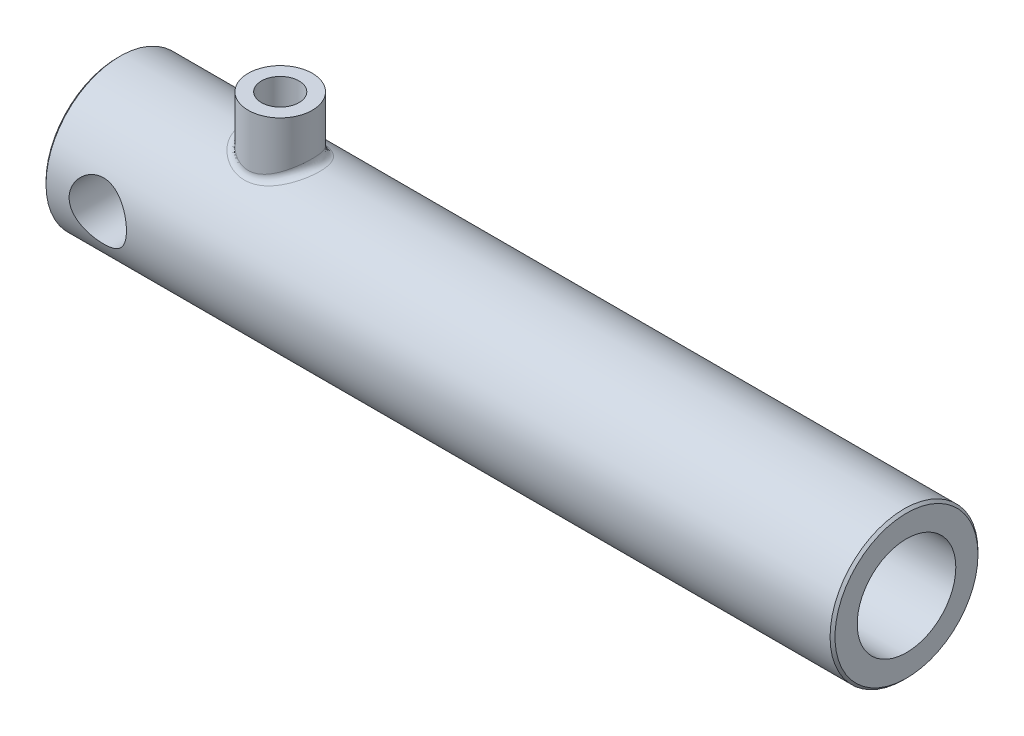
from build123d import *

# Parameters (mm, degrees)
ESQUISSE1_W                              = 320
ESQUISSE1_H                              = 30
ESQUISSE2_W                              = 13
ESQUISSE2_H                              = 22.962988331
D_GAGEMENT_M201_D                        = 23.25
DIAM_TRE_DU_PER_AGE_6_8_6_8_1_REACH      = 327.269
DIAM_TRE_DU_PER_AGE_6_8_6_8_1_BORE_R     = 3.4
DIAM_TRE_DU_PER_AGE_15_25_15_25_1_REACH  = 333.21
DIAM_TRE_DU_PER_AGE_15_25_15_25_1_BORE_R = 7.625
CHANFREIN1_SIZE                          = 1
CONG_1_R                                 = 2.999965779


with BuildPart() as part:
    # Esquisse1 → R_volution1 (revolve)
    with BuildSketch(Plane(origin=(0, 0, 0), x_dir=(-1, 0, 0), z_dir=(0, 0, -1)), mode=Mode.PRIVATE) as r_volution1_sk:
        with Locations((-160, 15)):
            Rectangle(ESQUISSE1_W, ESQUISSE1_H)
    revolve(r_volution1_sk.sketch.rotate(Axis((320, 0, 0), (-1, 0, 0)), 270), axis=Axis((320, 0, 0), (-1, 0, 0)))

    # Esquisse2 → R_volution2 (revolve)
    with BuildSketch(Plane(origin=(66, 0, 0), x_dir=(0, 0, -1), z_dir=(1, 0, 0))):
        with Locations((6.5, 38.518505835)):
            Rectangle(ESQUISSE2_W, ESQUISSE2_H)
    revolve(axis=Axis((66, 50, 0), (0, -1, 0)))

    # D_gagement M201 (through all)
    with Locations(Plane(origin=(22, 0, -30), x_dir=(0, -1, 0), z_dir=(0, 0, -1))):
        with Locations((0, 0)):
            Hole(D_GAGEMENT_M201_D / 2)

    # Diam_tre du per_age _6.8 _6.8_1 bore → Diam_tre du per_age _6.8 _6.8_1 (cut, up to next)
    with BuildSketch(Plane.ZY, mode=Mode.PRIVATE) as diam_tre_du_per_age_6_8_6_8_1_sk1:
        Circle(DIAM_TRE_DU_PER_AGE_6_8_6_8_1_BORE_R)
    diam_tre_du_per_age_6_8_6_8_1_tool1 = extrude(diam_tre_du_per_age_6_8_6_8_1_sk1.sketch, amount=-DIAM_TRE_DU_PER_AGE_6_8_6_8_1_REACH, mode=Mode.PRIVATE) & part.part
    add(diam_tre_du_per_age_6_8_6_8_1_tool1.solids().sort_by_distance((0, 0, 0))[0], mode=Mode.SUBTRACT)

    # Esquisse6 → Chambrage pour vis _ t_te hexagonale M48 (revolve, cut)
    with BuildSketch(Plane(origin=(320, 0, 0), x_dir=(0, 0, -1), z_dir=(0, 1, 0))):
        Polygon((0, 0), (0, 272), (25, 272), (25, 59), (20, 59), (20, 0), align=None)
    revolve(axis=Axis((326.35, 0, 0), (-1, 0, 0)), mode=Mode.SUBTRACT)

    # Diam_tre du per_age _15.25 _15.25_1 bore → Diam_tre du per_age _15.25 _15.25_1 (cut, up to next)
    with BuildSketch(Plane(origin=(0, 50, 0), x_dir=(1, 0, 0), z_dir=(0, 1, 0)), mode=Mode.PRIVATE) as diam_tre_du_per_age_15_25_15_25_1_sk1:
        with Locations((66, 0)):
            Circle(DIAM_TRE_DU_PER_AGE_15_25_15_25_1_BORE_R)
    diam_tre_du_per_age_15_25_15_25_1_tool1 = extrude(diam_tre_du_per_age_15_25_15_25_1_sk1.sketch, amount=-DIAM_TRE_DU_PER_AGE_15_25_15_25_1_REACH, mode=Mode.PRIVATE) & part.part
    add(diam_tre_du_per_age_15_25_15_25_1_tool1.solids().sort_by_distance((66, 50, 0))[0], mode=Mode.SUBTRACT)

    # Chanfrein1
    chanfrein1_edges = [part.edges().sort_by_distance(p)[0] for p in [
        (0, 0, -30),
        (320, 0, -30),
    ]]
    chamfer(chanfrein1_edges, length=CHANFREIN1_SIZE)

    # Cong_1
    cong_1_edges = [part.edges().sort_by_distance(p)[0] for p in [
        (66, 27.037011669, 13),
    ]]
    fillet(cong_1_edges, radius=CONG_1_R)


solid = part.part
